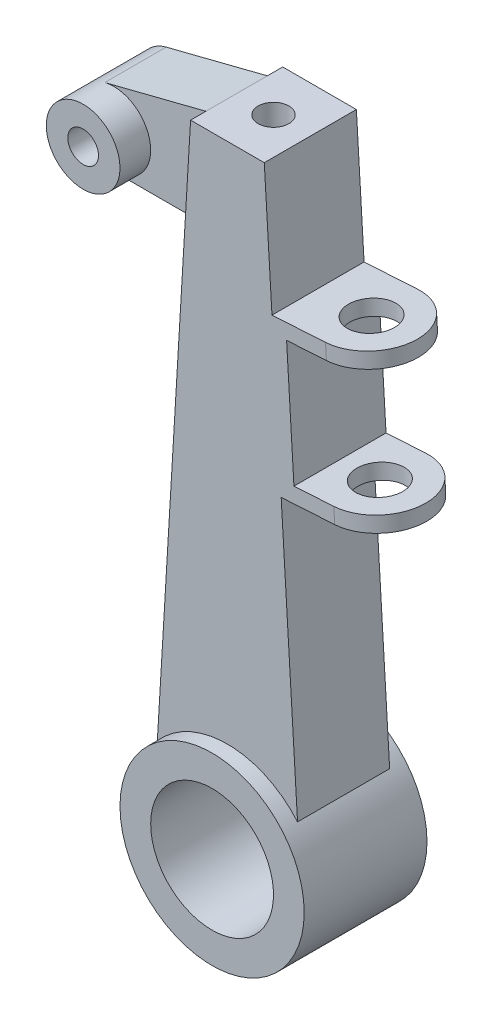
ISO-10303-21;
HEADER;
FILE_DESCRIPTION(('STEP AP214'),'2;1');
FILE_NAME('part.step','',(''),(''),'','','');
FILE_SCHEMA(('AUTOMOTIVE_DESIGN { 1 0 10303 214 1 1 1 1 }'));
ENDSEC;
DATA;
#1=APPLICATION_CONTEXT('core data for automotive mechanical design processes');
#2=APPLICATION_PROTOCOL_DEFINITION('international standard','automotive_design',2000,#1);
#3=PRODUCT_CONTEXT('',#1,'mechanical');
#4=PRODUCT('Part','Part','',(#3));
#5=PRODUCT_RELATED_PRODUCT_CATEGORY('part','',(#4));
#6=PRODUCT_DEFINITION_FORMATION('','',#4);
#7=PRODUCT_DEFINITION_CONTEXT('part definition',#1,'design');
#8=PRODUCT_DEFINITION('design','',#6,#7);
#9=PRODUCT_DEFINITION_SHAPE('','',#8);
#10=(LENGTH_UNIT() NAMED_UNIT(*) SI_UNIT(.MILLI.,.METRE.));
#11=(NAMED_UNIT(*) PLANE_ANGLE_UNIT() SI_UNIT($,.RADIAN.));
#12=(NAMED_UNIT(*) SI_UNIT($,.STERADIAN.) SOLID_ANGLE_UNIT());
#13=UNCERTAINTY_MEASURE_WITH_UNIT(LENGTH_MEASURE(1.E-05),#10,'distance_accuracy_value','');
#14=(GEOMETRIC_REPRESENTATION_CONTEXT(3) GLOBAL_UNCERTAINTY_ASSIGNED_CONTEXT((#13)) GLOBAL_UNIT_ASSIGNED_CONTEXT((#10,
#11,#12)) REPRESENTATION_CONTEXT('',''));
#15=CARTESIAN_POINT('',(0.,0.,0.));
#16=DIRECTION('',(0.,0.,1.));
#17=DIRECTION('',(1.,0.,0.));
#18=AXIS2_PLACEMENT_3D('',#15,#16,#17);
#19=CARTESIAN_POINT('',(-11.5353761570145,-3.23596435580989,12.2157183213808));
#20=DIRECTION('',(4.96598466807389E-05,2.97959143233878E-06,0.999999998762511));
#21=DIRECTION('',(0.99999999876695,0.,-4.96598466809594E-05));
#22=AXIS2_PLACEMENT_3D('',#19,#20,#21);
#23=PLANE('',#22);
#24=CARTESIAN_POINT('',(-19.0493937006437,-12.6999631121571,12.2161196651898));
#25=DIRECTION('',(-4.96598467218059E-05,-2.97959144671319E-06,-0.999999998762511));
#26=DIRECTION('',(-0.99999999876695,0.,4.96598467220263E-05));
#27=AXIS2_PLACEMENT_3D('',#24,#25,#26);
#28=CIRCLE('',#27,7.61999999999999);
#29=CARTESIAN_POINT('',(-26.6693936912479,-12.6999631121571,12.2164980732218));
#30=VERTEX_POINT('',#29);
#31=EDGE_CURVE('E354',#30,#30,#28,.T.);
#32=ORIENTED_EDGE('',*,*,#31,.F.);
#33=EDGE_LOOP('',(#32));
#34=FACE_BOUND('',#33,.T.);
#35=CARTESIAN_POINT('',(-19.0493937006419,-12.6999631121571,12.21611966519));
#36=DIRECTION('',(-4.96598467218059E-05,-2.97959144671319E-06,-0.999999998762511));
#37=DIRECTION('',(-0.99999999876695,0.,4.96598467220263E-05));
#38=AXIS2_PLACEMENT_3D('',#35,#36,#37);
#39=CIRCLE('',#38,3.17500000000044);
#40=CARTESIAN_POINT('',(-22.2243936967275,-12.6999631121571,12.2162773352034));
#41=VERTEX_POINT('',#40);
#42=EDGE_CURVE('E38',#41,#41,#39,.T.);
#43=ORIENTED_EDGE('',*,*,#42,.T.);
#44=EDGE_LOOP('',(#43));
#45=FACE_BOUND('',#44,.T.);
#46=ADVANCED_FACE('F34',(#34,#45),#23,.T.);
#47=CARTESIAN_POINT('',(7.61997558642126,-12.7000016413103,-0.485204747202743));
#48=DIRECTION('',(-2.56616028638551E-08,-0.999999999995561,2.97959271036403E-06));
#49=DIRECTION('',(0.,-2.97959271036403E-06,-0.999999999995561));
#50=AXIS2_PLACEMENT_3D('',#47,#48,#49);
#51=PLANE('',#50);
#52=CARTESIAN_POINT('',(7.61997558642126,-12.7000016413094,-0.485204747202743));
#53=DIRECTION('',(-2.56616425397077E-08,-0.999999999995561,2.97959271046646E-06));
#54=DIRECTION('',(0.,-2.97959271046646E-06,-0.999999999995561));
#55=AXIS2_PLACEMENT_3D('',#52,#53,#54);
#56=CIRCLE('',#55,3.175);
#57=CARTESIAN_POINT('',(7.61997558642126,-12.7000111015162,-3.66020474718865));
#58=VERTEX_POINT('',#57);
#59=EDGE_CURVE('E132',#58,#58,#56,.F.);
#60=ORIENTED_EDGE('',*,*,#59,.T.);
#61=EDGE_LOOP('',(#60));
#62=FACE_BOUND('',#61,.T.);
#63=ADVANCED_FACE('F364',(#62),#51,.F.);
#64=CARTESIAN_POINT('',(-19.0493937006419,-12.6999631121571,12.2161196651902));
#65=DIRECTION('',(-4.96598467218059E-05,-2.97959144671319E-06,-0.999999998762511));
#66=DIRECTION('',(-0.99999999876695,0.,4.96598467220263E-05));
#67=AXIS2_PLACEMENT_3D('',#64,#65,#66);
#68=CYLINDRICAL_SURFACE('',#67,3.17500000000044);
#69=ORIENTED_EDGE('',*,*,#42,.F.);
#70=EDGE_LOOP('',(#69));
#71=FACE_BOUND('',#70,.T.);
#72=CARTESIAN_POINT('',(-19.050339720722,-12.7000198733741,-6.83388031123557));
#73=DIRECTION('',(-4.96598467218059E-05,-2.97959144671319E-06,-0.999999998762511));
#74=DIRECTION('',(-0.99999999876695,0.,4.96598467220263E-05));
#75=AXIS2_PLACEMENT_3D('',#72,#73,#74);
#76=CIRCLE('',#75,3.17500000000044);
#77=CARTESIAN_POINT('',(-22.2253397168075,-12.7000198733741,-6.83372264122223));
#78=VERTEX_POINT('',#77);
#79=EDGE_CURVE('E152',#78,#78,#76,.F.);
#80=ORIENTED_EDGE('',*,*,#79,.F.);
#81=EDGE_LOOP('',(#80));
#82=FACE_BOUND('',#81,.T.);
#83=ADVANCED_FACE('F361',(#71,#82),#68,.F.);
#84=CARTESIAN_POINT('',(-19.0493937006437,-12.6999631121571,12.2161196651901));
#85=DIRECTION('',(-4.96598467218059E-05,-2.97959144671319E-06,-0.999999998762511));
#86=DIRECTION('',(-0.99999999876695,0.,4.96598467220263E-05));
#87=AXIS2_PLACEMENT_3D('',#84,#85,#86);
#88=CYLINDRICAL_SURFACE('',#87,7.61999999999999);
#89=CARTESIAN_POINT('',(-19.0497090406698,-12.6999820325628,5.86611967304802));
#90=DIRECTION('',(-4.96598467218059E-05,-2.97959144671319E-06,-0.999999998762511));
#91=DIRECTION('',(-0.99999999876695,0.,4.96598467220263E-05));
#92=AXIS2_PLACEMENT_3D('',#89,#90,#91);
#93=CIRCLE('',#92,7.61999999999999);
#94=CARTESIAN_POINT('',(-20.9254011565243,-5.31444352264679,5.86619081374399));
#95=VERTEX_POINT('',#94);
#96=CARTESIAN_POINT('',(-19.0497092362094,-20.3199820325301,5.86614237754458));
#97=VERTEX_POINT('',#96);
#98=EDGE_CURVE('E111',#95,#97,#93,.T.);
#99=ORIENTED_EDGE('',*,*,#98,.F.);
#100=DIRECTION('',(4.96598466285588E-05,2.97959144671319E-06,0.999999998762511));
#101=VECTOR('',#100,1.);
#102=CARTESIAN_POINT('',(-20.9260318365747,-5.31448136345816,-6.83380917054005));
#103=LINE('',#102,#101);
#104=CARTESIAN_POINT('',(-20.9260318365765,-5.31448136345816,-6.83380917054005));
#105=VERTEX_POINT('',#104);
#106=EDGE_CURVE('E117',#105,#95,#103,.T.);
#107=ORIENTED_EDGE('',*,*,#106,.F.);
#108=CARTESIAN_POINT('',(-19.0503397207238,-12.7000198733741,-6.83388031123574));
#109=DIRECTION('',(-4.96598467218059E-05,-2.97959144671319E-06,-0.999999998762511));
#110=DIRECTION('',(-0.99999999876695,0.,4.96598467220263E-05));
#111=AXIS2_PLACEMENT_3D('',#108,#109,#110);
#112=CIRCLE('',#111,7.61999999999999);
#113=CARTESIAN_POINT('',(-19.0503398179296,-20.3200201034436,-6.83385760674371));
#114=VERTEX_POINT('',#113);
#115=EDGE_CURVE('E146',#114,#105,#112,.T.);
#116=ORIENTED_EDGE('',*,*,#115,.F.);
#117=DIRECTION('',(-4.96598467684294E-05,-2.97959144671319E-06,-0.999999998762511));
#118=VECTOR('',#117,1.);
#119=CARTESIAN_POINT('',(-19.0497092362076,-20.3199820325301,5.86614237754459));
#120=LINE('',#119,#118);
#121=EDGE_CURVE('E120',#97,#114,#120,.T.);
#122=ORIENTED_EDGE('',*,*,#121,.F.);
#123=EDGE_LOOP('',(#99,#107,#116,#122));
#124=FACE_BOUND('',#123,.T.);
#125=ORIENTED_EDGE('',*,*,#31,.T.);
#126=EDGE_LOOP('',(#125));
#127=FACE_BOUND('',#126,.T.);
#128=ADVANCED_FACE('F115',(#124,#127),#88,.T.);
#129=CARTESIAN_POINT('',(27.903497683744,-25.8530921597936,-0.486172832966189));
#130=DIRECTION('',(0.0598922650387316,-0.998204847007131,1.9112008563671E-12));
#131=DIRECTION('',(0.998204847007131,0.0598922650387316,0.));
#132=AXIS2_PLACEMENT_3D('',#129,#130,#131);
#133=CYLINDRICAL_SURFACE('',#132,4.7625);
#134=CARTESIAN_POINT('',(27.903497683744,-25.8530921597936,-0.486172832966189));
#135=DIRECTION('',(0.0598922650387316,-0.998204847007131,1.9112008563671E-12));
#136=DIRECTION('',(0.998204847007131,0.0598922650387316,0.));
#137=AXIS2_PLACEMENT_3D('',#134,#135,#136);
#138=CIRCLE('',#137,4.7625);
#139=CARTESIAN_POINT('',(32.6574482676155,-25.5678552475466,-0.486172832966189));
#140=VERTEX_POINT('',#139);
#141=EDGE_CURVE('E341',#140,#140,#138,.T.);
#142=ORIENTED_EDGE('',*,*,#141,.F.);
#143=EDGE_LOOP('',(#142));
#144=FACE_BOUND('',#143,.T.);
#145=CARTESIAN_POINT('',(28.093655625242,-29.022392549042,-0.486172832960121));
#146=DIRECTION('',(0.0598922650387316,-0.998204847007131,1.9112008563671E-12));
#147=DIRECTION('',(0.998204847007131,0.0598922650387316,0.));
#148=AXIS2_PLACEMENT_3D('',#145,#146,#147);
#149=CIRCLE('',#148,4.7625);
#150=CARTESIAN_POINT('',(32.8476062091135,-28.737155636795,-0.486172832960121));
#151=VERTEX_POINT('',#150);
#152=EDGE_CURVE('E242',#151,#151,#149,.F.);
#153=ORIENTED_EDGE('',*,*,#152,.F.);
#154=EDGE_LOOP('',(#153));
#155=FACE_BOUND('',#154,.T.);
#156=ADVANCED_FACE('F651',(#144,#155),#133,.F.);
#157=CARTESIAN_POINT('',(7.61997591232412,-1.64136740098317E-06,-0.485242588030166));
#158=DIRECTION('',(-2.56616425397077E-08,-0.999999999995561,2.97959271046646E-06));
#159=DIRECTION('',(0.,-2.97959271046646E-06,-0.999999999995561));
#160=AXIS2_PLACEMENT_3D('',#157,#158,#159);
#161=CYLINDRICAL_SURFACE('',#160,3.175);
#162=CARTESIAN_POINT('',(7.61997591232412,-1.64136740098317E-06,-0.485242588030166));
#163=DIRECTION('',(-2.56616425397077E-08,-0.999999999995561,2.97959271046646E-06));
#164=DIRECTION('',(0.,-2.97959271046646E-06,-0.999999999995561));
#165=AXIS2_PLACEMENT_3D('',#162,#163,#164);
#166=CIRCLE('',#165,3.175);
#167=CARTESIAN_POINT('',(7.61997591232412,-1.11015742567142E-05,-3.66024258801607));
#168=VERTEX_POINT('',#167);
#169=EDGE_CURVE('E222',#168,#168,#166,.T.);
#170=ORIENTED_EDGE('',*,*,#169,.F.);
#171=EDGE_LOOP('',(#170));
#172=FACE_BOUND('',#171,.T.);
#173=ORIENTED_EDGE('',*,*,#59,.F.);
#174=EDGE_LOOP('',(#173));
#175=FACE_BOUND('',#174,.T.);
#176=ADVANCED_FACE('F660',(#172,#175),#161,.F.);
#177=CARTESIAN_POINT('',(-2.40782800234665E-05,-1.44469716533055E-06,-0.484864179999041));
#178=DIRECTION('',(-0.246153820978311,0.969230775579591,9.33604930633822E-06));
#179=DIRECTION('',(-0.969230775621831,-0.246153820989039,0.));
#180=AXIS2_PLACEMENT_3D('',#177,#178,#179);
#181=PLANE('',#180);
#182=DIRECTION('',(-0.969230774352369,-0.246153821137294,4.88652895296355E-05));
#183=VECTOR('',#182,1.);
#184=CARTESIAN_POINT('',(0.000291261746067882,1.74757076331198E-05,5.8651358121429));
#185=LINE('',#184,#183);
#186=CARTESIAN_POINT('',(0.000291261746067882,1.74757076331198E-05,5.86513581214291));
#187=VERTEX_POINT('',#186);
#188=EDGE_CURVE('E122',#187,#95,#185,.T.);
#189=ORIENTED_EDGE('',*,*,#188,.F.);
#190=DIRECTION('',(4.96598467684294E-05,2.97959144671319E-06,0.999999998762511));
#191=VECTOR('',#190,1.);
#192=CARTESIAN_POINT('',(-0.000339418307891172,-2.03651028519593E-05,-6.83486417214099));
#193=LINE('',#192,#191);
#194=CARTESIAN_POINT('',(-0.000339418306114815,-2.03651028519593E-05,-6.83486417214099));
#195=VERTEX_POINT('',#194);
#196=EDGE_CURVE('E211',#195,#187,#193,.T.);
#197=ORIENTED_EDGE('',*,*,#196,.F.);
#198=DIRECTION('',(0.969230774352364,0.246153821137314,-4.88652895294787E-05));
#199=VECTOR('',#198,1.);
#200=CARTESIAN_POINT('',(-20.9260318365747,-5.31448136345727,-6.83380917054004));
#201=LINE('',#200,#199);
#202=EDGE_CURVE('E130',#105,#195,#201,.T.);
#203=ORIENTED_EDGE('',*,*,#202,.F.);
#204=ORIENTED_EDGE('',*,*,#106,.T.);
#205=EDGE_LOOP('',(#189,#197,#203,#204));
#206=FACE_BOUND('',#205,.T.);
#207=ADVANCED_FACE('F126',(#206),#181,.T.);
#208=CARTESIAN_POINT('',(29.6149191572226,-54.3767956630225,-0.486172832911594));
#209=DIRECTION('',(0.0598922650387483,-0.99820484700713,1.91120085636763E-12));
#210=DIRECTION('',(0.99820484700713,0.0598922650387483,0.));
#211=AXIS2_PLACEMENT_3D('',#208,#209,#210);
#212=CYLINDRICAL_SURFACE('',#211,4.7625);
#213=CARTESIAN_POINT('',(29.6149191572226,-54.3767956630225,-0.486172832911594));
#214=DIRECTION('',(0.0598922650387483,-0.99820484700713,1.91120085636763E-12));
#215=DIRECTION('',(0.99820484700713,0.0598922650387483,0.));
#216=AXIS2_PLACEMENT_3D('',#213,#214,#215);
#217=CIRCLE('',#216,4.7625);
#218=CARTESIAN_POINT('',(34.3688697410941,-54.0915587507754,-0.486172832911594));
#219=VERTEX_POINT('',#218);
#220=EDGE_CURVE('E145',#219,#219,#217,.T.);
#221=ORIENTED_EDGE('',*,*,#220,.F.);
#222=EDGE_LOOP('',(#221));
#223=FACE_BOUND('',#222,.T.);
#224=CARTESIAN_POINT('',(29.8050770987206,-57.5460960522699,-0.486172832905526));
#225=DIRECTION('',(0.0598922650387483,-0.99820484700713,1.91120085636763E-12));
#226=DIRECTION('',(0.99820484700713,0.0598922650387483,0.));
#227=AXIS2_PLACEMENT_3D('',#224,#225,#226);
#228=CIRCLE('',#227,4.7625);
#229=CARTESIAN_POINT('',(34.5590276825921,-57.2608591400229,-0.486172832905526));
#230=VERTEX_POINT('',#229);
#231=EDGE_CURVE('E210',#230,#230,#228,.F.);
#232=ORIENTED_EDGE('',*,*,#231,.F.);
#233=EDGE_LOOP('',(#232));
#234=FACE_BOUND('',#233,.T.);
#235=ADVANCED_FACE('F407',(#223,#234),#212,.F.);
#236=CARTESIAN_POINT('',(7.62060333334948,-126.999963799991,12.2151358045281));
#237=DIRECTION('',(-4.96598466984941E-05,-2.97959144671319E-06,-0.999999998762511));
#238=DIRECTION('',(-0.99999999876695,0.,4.96598466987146E-05));
#239=AXIS2_PLACEMENT_3D('',#236,#237,#238);
#240=CYLINDRICAL_SURFACE('',#239,12.7);
#241=CARTESIAN_POINT('',(7.62060333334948,-126.999963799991,12.2151358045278));
#242=DIRECTION('',(-4.96598466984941E-05,-2.97959144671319E-06,-0.999999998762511));
#243=DIRECTION('',(-0.99999999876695,0.,4.96598466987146E-05));
#244=AXIS2_PLACEMENT_3D('',#241,#242,#243);
#245=CIRCLE('',#244,12.7);
#246=CARTESIAN_POINT('',(-5.07939665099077,-126.999963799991,12.2157664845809));
#247=VERTEX_POINT('',#246);
#248=EDGE_CURVE('E195',#247,#247,#245,.T.);
#249=ORIENTED_EDGE('',*,*,#248,.F.);
#250=EDGE_LOOP('',(#249));
#251=FACE_BOUND('',#250,.T.);
#252=CARTESIAN_POINT('',(7.61934197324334,-127.000039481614,-13.18486416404));
#253=DIRECTION('',(-4.96598466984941E-05,-2.97959144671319E-06,-0.999999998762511));
#254=DIRECTION('',(-0.99999999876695,0.,4.96598466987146E-05));
#255=AXIS2_PLACEMENT_3D('',#252,#253,#254);
#256=CIRCLE('',#255,12.7);
#257=CARTESIAN_POINT('',(-5.08065801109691,-127.000039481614,-13.1842334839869));
#258=VERTEX_POINT('',#257);
#259=EDGE_CURVE('E328',#258,#258,#256,.T.);
#260=ORIENTED_EDGE('',*,*,#259,.T.);
#261=EDGE_LOOP('',(#260));
#262=FACE_BOUND('',#261,.T.);
#263=ADVANCED_FACE('F404',(#251,#262),#240,.F.);
#264=CARTESIAN_POINT('',(-46.6009311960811,4.83376644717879,5.86743561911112));
#265=DIRECTION('',(4.96598466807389E-05,2.97959143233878E-06,0.999999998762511));
#266=DIRECTION('',(0.99999999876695,0.,-4.96598466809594E-05));
#267=AXIS2_PLACEMENT_3D('',#264,#265,#266);
#268=PLANE('',#267);
#269=DIRECTION('',(-0.0598923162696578,-0.998204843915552,5.94848585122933E-06));
#270=VECTOR('',#269,1.);
#271=CARTESIAN_POINT('',(0.000291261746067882,1.74757076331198E-05,5.86513581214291));
#272=LINE('',#271,#270);
#273=CARTESIAN_POINT('',(-1.21890925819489,-20.3199824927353,5.86525690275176));
#274=VERTEX_POINT('',#273);
#275=EDGE_CURVE('E136',#187,#274,#272,.T.);
#276=ORIENTED_EDGE('',*,*,#275,.F.);
#277=ORIENTED_EDGE('',*,*,#188,.T.);
#278=ORIENTED_EDGE('',*,*,#98,.T.);
#279=DIRECTION('',(-0.999999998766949,2.58096156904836E-08,4.96598466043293E-05));
#280=VECTOR('',#279,1.);
#281=CARTESIAN_POINT('',(-1.21890925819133,-20.3199824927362,5.86525690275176));
#282=LINE('',#281,#280);
#283=EDGE_CURVE('E138',#274,#97,#282,.T.);
#284=ORIENTED_EDGE('',*,*,#283,.F.);
#285=EDGE_LOOP('',(#276,#277,#278,#284));
#286=FACE_BOUND('',#285,.T.);
#287=ADVANCED_FACE('F134',(#286),#268,.T.);
#288=CARTESIAN_POINT('',(-19.0500245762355,-20.3200009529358,-0.48385761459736));
#289=DIRECTION('',(-2.56616028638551E-08,-0.999999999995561,2.97959271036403E-06));
#290=DIRECTION('',(0.,-2.97959271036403E-06,-0.999999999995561));
#291=AXIS2_PLACEMENT_3D('',#288,#289,#290);
#292=PLANE('',#291);
#293=ORIENTED_EDGE('',*,*,#283,.T.);
#294=ORIENTED_EDGE('',*,*,#121,.T.);
#295=DIRECTION('',(-0.99999999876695,0.,4.96598466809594E-05));
#296=VECTOR('',#295,1.);
#297=CARTESIAN_POINT('',(-19.0503399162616,-20.3200203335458,-6.83385760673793));
#298=LINE('',#297,#296);
#299=CARTESIAN_POINT('',(-1.21953993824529,-20.3200203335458,-6.83474308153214));
#300=VERTEX_POINT('',#299);
#301=EDGE_CURVE('E149',#300,#114,#298,.T.);
#302=ORIENTED_EDGE('',*,*,#301,.F.);
#303=DIRECTION('',(-4.96598466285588E-05,-2.97959137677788E-06,-0.999999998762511));
#304=VECTOR('',#303,1.);
#305=CARTESIAN_POINT('',(-1.21890925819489,-20.3199824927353,5.86525690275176));
#306=LINE('',#305,#304);
#307=EDGE_CURVE('E273',#274,#300,#306,.T.);
#308=ORIENTED_EDGE('',*,*,#307,.F.);
#309=EDGE_LOOP('',(#293,#294,#302,#308));
#310=FACE_BOUND('',#309,.T.);
#311=ADVANCED_FACE('F371',(#310),#292,.T.);
#312=CARTESIAN_POINT('',(-19.0503399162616,-20.3200198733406,-6.8338576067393));
#313=DIRECTION('',(-4.96598466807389E-05,-2.97959143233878E-06,-0.999999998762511));
#314=DIRECTION('',(-0.99999999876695,0.,4.96598466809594E-05));
#315=AXIS2_PLACEMENT_3D('',#312,#313,#314);
#316=PLANE('',#315);
#317=ORIENTED_EDGE('',*,*,#202,.T.);
#318=DIRECTION('',(0.0598923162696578,0.998204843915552,-5.94848585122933E-06));
#319=VECTOR('',#318,1.);
#320=CARTESIAN_POINT('',(-1.21953993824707,-20.3200203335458,-6.83474308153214));
#321=LINE('',#320,#319);
#322=EDGE_CURVE('E199',#300,#195,#321,.T.);
#323=ORIENTED_EDGE('',*,*,#322,.F.);
#324=ORIENTED_EDGE('',*,*,#301,.T.);
#325=ORIENTED_EDGE('',*,*,#115,.T.);
#326=EDGE_LOOP('',(#317,#323,#324,#325));
#327=FACE_BOUND('',#326,.T.);
#328=ORIENTED_EDGE('',*,*,#79,.T.);
#329=EDGE_LOOP('',(#328));
#330=FACE_BOUND('',#329,.T.);
#331=ADVANCED_FACE('F368',(#327,#330),#316,.T.);
#332=CARTESIAN_POINT('',(21.3747381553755,-54.8712063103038,-0.485762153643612));
#333=DIRECTION('',(-0.0598922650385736,0.998204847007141,-1.91068377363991E-12));
#334=DIRECTION('',(-0.998204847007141,-0.0598922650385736,0.));
#335=AXIS2_PLACEMENT_3D('',#332,#333,#334);
#336=PLANE('',#335);
#337=DIRECTION('',(0.998204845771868,0.0598922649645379,-4.97491541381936E-05));
#338=VECTOR('',#337,1.);
#339=CARTESIAN_POINT('',(21.3752111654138,-54.8711779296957,9.0392378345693));
#340=LINE('',#339,#338);
#341=CARTESIAN_POINT('',(21.375211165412,-54.8711779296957,9.03923783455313));
#342=VERTEX_POINT('',#341);
#343=CARTESIAN_POINT('',(29.6153921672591,-54.3767672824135,9.03882715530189));
#344=VERTEX_POINT('',#343);
#345=EDGE_CURVE('E286',#342,#344,#340,.T.);
#346=ORIENTED_EDGE('',*,*,#345,.T.);
#347=CARTESIAN_POINT('',(29.6149191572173,-54.3767956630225,-0.486172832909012));
#348=DIRECTION('',(-0.0598922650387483,0.99820484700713,-1.91120085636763E-12));
#349=DIRECTION('',(-0.99820484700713,-0.0598922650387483,0.));
#350=AXIS2_PLACEMENT_3D('',#347,#348,#349);
#351=CIRCLE('',#350,9.52500000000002);
#352=CARTESIAN_POINT('',(29.614446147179,-54.3768240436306,-10.0111728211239));
#353=VERTEX_POINT('',#352);
#354=EDGE_CURVE('E331',#353,#344,#351,.F.);
#355=ORIENTED_EDGE('',*,*,#354,.F.);
#356=DIRECTION('',(-0.998204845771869,-0.059892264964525,4.97491541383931E-05));
#357=VECTOR('',#356,1.);
#358=CARTESIAN_POINT('',(29.6144461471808,-54.3768240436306,-10.0111728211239));
#359=LINE('',#358,#357);
#360=CARTESIAN_POINT('',(21.3742651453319,-54.8712346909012,-10.0107621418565));
#361=VERTEX_POINT('',#360);
#362=EDGE_CURVE('E247',#353,#361,#359,.T.);
#363=ORIENTED_EDGE('',*,*,#362,.T.);
#364=DIRECTION('',(4.96598467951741E-05,2.97958952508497E-06,0.999999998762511));
#365=VECTOR('',#364,1.);
#366=CARTESIAN_POINT('',(21.3747381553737,-54.871206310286,-0.485762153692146));
#367=LINE('',#366,#365);
#368=EDGE_CURVE('E250',#342,#361,#367,.F.);
#369=ORIENTED_EDGE('',*,*,#368,.F.);
#370=EDGE_LOOP('',(#346,#355,#363,#369));
#371=FACE_BOUND('',#370,.T.);
#372=ORIENTED_EDGE('',*,*,#220,.T.);
#373=EDGE_LOOP('',(#372));
#374=FACE_BOUND('',#373,.T.);
#375=ADVANCED_FACE('F370',(#371,#374),#336,.T.);
#376=CARTESIAN_POINT('',(19.8534746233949,-29.5168031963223,-0.485762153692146));
#377=DIRECTION('',(0.998204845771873,0.0598922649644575,-4.97491541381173E-05));
#378=DIRECTION('',(-0.0598922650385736,0.998204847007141,0.));
#379=AXIS2_PLACEMENT_3D('',#376,#377,#378);
#380=PLANE('',#379);
#381=DIRECTION('',(-0.059892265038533,0.998204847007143,-1.91092767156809E-12));
#382=VECTOR('',#381,1.);
#383=CARTESIAN_POINT('',(21.3742651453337,-54.8712346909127,-10.0107621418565));
#384=LINE('',#383,#382);
#385=CARTESIAN_POINT('',(19.8530016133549,-29.5168315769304,-10.0107621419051));
#386=VERTEX_POINT('',#385);
#387=EDGE_CURVE('E235',#361,#386,#384,.T.);
#388=ORIENTED_EDGE('',*,*,#387,.T.);
#389=DIRECTION('',(-4.96598466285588E-05,-2.97959140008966E-06,-0.999999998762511));
#390=VECTOR('',#389,1.);
#391=CARTESIAN_POINT('',(19.8539476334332,-29.5167748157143,9.03923783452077));
#392=LINE('',#391,#390);
#393=CARTESIAN_POINT('',(19.8539476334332,-29.5167748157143,9.03923783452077));
#394=VERTEX_POINT('',#393);
#395=EDGE_CURVE('E238',#394,#386,#392,.T.);
#396=ORIENTED_EDGE('',*,*,#395,.F.);
#397=DIRECTION('',(0.0598922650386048,-0.998204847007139,1.91065448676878E-12));
#398=VECTOR('',#397,1.);
#399=CARTESIAN_POINT('',(19.8539476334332,-29.5167748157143,9.03923783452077));
#400=LINE('',#399,#398);
#401=EDGE_CURVE('E289',#394,#342,#400,.T.);
#402=ORIENTED_EDGE('',*,*,#401,.T.);
#403=ORIENTED_EDGE('',*,*,#368,.T.);
#404=EDGE_LOOP('',(#388,#396,#402,#403));
#405=FACE_BOUND('',#404,.T.);
#406=ADVANCED_FACE('F378',(#405),#380,.T.);
#407=CARTESIAN_POINT('',(37.6015567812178,-28.451918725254,-0.486646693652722));
#408=DIRECTION('',(0.0598922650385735,-0.998204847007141,1.91068377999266E-12));
#409=DIRECTION('',(0.998204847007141,0.0598922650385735,0.));
#410=AXIS2_PLACEMENT_3D('',#407,#408,#409);
#411=PLANE('',#410);
#412=DIRECTION('',(0.998204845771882,0.0598922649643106,-4.97491541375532E-05));
#413=VECTOR('',#412,1.);
#414=CARTESIAN_POINT('',(19.8530016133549,-29.5168315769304,-10.0107621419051));
#415=LINE('',#414,#413);
#416=CARTESIAN_POINT('',(28.093182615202,-29.02242092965,-10.0111728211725));
#417=VERTEX_POINT('',#416);
#418=EDGE_CURVE('E233',#386,#417,#415,.T.);
#419=ORIENTED_EDGE('',*,*,#418,.T.);
#420=CARTESIAN_POINT('',(28.0936556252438,-29.0223925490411,-0.48617283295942));
#421=DIRECTION('',(0.059892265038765,-0.998204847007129,1.91120085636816E-12));
#422=DIRECTION('',(0.998204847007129,0.059892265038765,0.));
#423=AXIS2_PLACEMENT_3D('',#420,#421,#422);
#424=CIRCLE('',#423,9.52500000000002);
#425=CARTESIAN_POINT('',(28.0941286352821,-29.0223641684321,9.03882715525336));
#426=VERTEX_POINT('',#425);
#427=EDGE_CURVE('E241',#426,#417,#424,.F.);
#428=ORIENTED_EDGE('',*,*,#427,.F.);
#429=DIRECTION('',(-0.998204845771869,-0.059892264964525,4.97491541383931E-05));
#430=VECTOR('',#429,1.);
#431=CARTESIAN_POINT('',(28.0941286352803,-29.0223641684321,9.03882715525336));
#432=LINE('',#431,#430);
#433=EDGE_CURVE('E296',#426,#394,#432,.T.);
#434=ORIENTED_EDGE('',*,*,#433,.T.);
#435=ORIENTED_EDGE('',*,*,#395,.T.);
#436=EDGE_LOOP('',(#419,#428,#434,#435));
#437=FACE_BOUND('',#436,.T.);
#438=ORIENTED_EDGE('',*,*,#152,.T.);
#439=EDGE_LOOP('',(#438));
#440=FACE_BOUND('',#439,.T.);
#441=ADVANCED_FACE('F490',(#437,#440),#411,.T.);
#442=CARTESIAN_POINT('',(27.9034976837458,-25.8530921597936,-0.486172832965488));
#443=DIRECTION('',(0.059892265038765,-0.998204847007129,1.91120085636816E-12));
#444=DIRECTION('',(0.998204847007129,0.059892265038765,0.));
#445=AXIS2_PLACEMENT_3D('',#442,#443,#444);
#446=CYLINDRICAL_SURFACE('',#445,9.52500000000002);
#447=DIRECTION('',(-0.0598922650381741,0.998204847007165,-1.91229359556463E-12));
#448=VECTOR('',#447,1.);
#449=CARTESIAN_POINT('',(28.093182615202,-29.02242092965,-10.0111728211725));
#450=LINE('',#449,#448);
#451=CARTESIAN_POINT('',(27.9030246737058,-25.8531205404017,-10.0111728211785));
#452=VERTEX_POINT('',#451);
#453=EDGE_CURVE('E228',#417,#452,#450,.T.);
#454=ORIENTED_EDGE('',*,*,#453,.T.);
#455=CARTESIAN_POINT('',(27.9034976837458,-25.8530921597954,-0.486172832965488));
#456=DIRECTION('',(0.059892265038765,-0.998204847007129,1.91120085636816E-12));
#457=DIRECTION('',(0.998204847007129,0.059892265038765,0.));
#458=AXIS2_PLACEMENT_3D('',#455,#456,#457);
#459=CIRCLE('',#458,9.52500000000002);
#460=CARTESIAN_POINT('',(27.9039706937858,-25.8530637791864,9.0388271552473));
#461=VERTEX_POINT('',#460);
#462=EDGE_CURVE('E223',#461,#452,#459,.F.);
#463=ORIENTED_EDGE('',*,*,#462,.F.);
#464=DIRECTION('',(0.0598922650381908,-0.998204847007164,1.91010811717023E-12));
#465=VECTOR('',#464,1.);
#466=CARTESIAN_POINT('',(27.903970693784,-25.8530637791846,9.03882715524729));
#467=LINE('',#466,#465);
#468=EDGE_CURVE('E301',#461,#426,#467,.T.);
#469=ORIENTED_EDGE('',*,*,#468,.T.);
#470=ORIENTED_EDGE('',*,*,#427,.T.);
#471=EDGE_LOOP('',(#454,#463,#469,#470));
#472=FACE_BOUND('',#471,.T.);
#473=ADVANCED_FACE('F494',(#472),#446,.T.);
#474=CARTESIAN_POINT('',(7.46784879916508,-27.0792305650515,-0.485154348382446));
#475=DIRECTION('',(-0.0598922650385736,0.998204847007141,-1.91068377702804E-12));
#476=DIRECTION('',(-0.998204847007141,-0.0598922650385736,0.));
#477=AXIS2_PLACEMENT_3D('',#474,#475,#476);
#478=PLANE('',#477);
#479=DIRECTION('',(0.998204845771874,0.0598922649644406,-4.97491541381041E-05));
#480=VECTOR('',#479,1.);
#481=CARTESIAN_POINT('',(16.8314945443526,-26.517412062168,9.03937899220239));
#482=LINE('',#481,#480);
#483=CARTESIAN_POINT('',(16.8314945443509,-26.517412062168,9.03937899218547));
#484=VERTEX_POINT('',#483);
#485=EDGE_CURVE('E306',#484,#461,#482,.T.);
#486=ORIENTED_EDGE('',*,*,#485,.T.);
#487=ORIENTED_EDGE('',*,*,#462,.T.);
#488=DIRECTION('',(-0.998204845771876,-0.0598922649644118,4.97491541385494E-05));
#489=VECTOR('',#488,1.);
#490=CARTESIAN_POINT('',(27.9030246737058,-25.8531205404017,-10.0111728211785));
#491=LINE('',#490,#489);
#492=CARTESIAN_POINT('',(16.8305485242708,-26.5174688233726,-10.0106209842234));
#493=VERTEX_POINT('',#492);
#494=EDGE_CURVE('E216',#452,#493,#491,.T.);
#495=ORIENTED_EDGE('',*,*,#494,.T.);
#496=DIRECTION('',(4.96598467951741E-05,2.97958952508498E-06,0.999999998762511));
#497=VECTOR('',#496,1.);
#498=CARTESIAN_POINT('',(16.8310215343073,-26.5174404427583,-0.485620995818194));
#499=LINE('',#498,#497);
#500=EDGE_CURVE('E219',#484,#493,#499,.F.);
#501=ORIENTED_EDGE('',*,*,#500,.F.);
#502=EDGE_LOOP('',(#486,#487,#495,#501));
#503=FACE_BOUND('',#502,.T.);
#504=ORIENTED_EDGE('',*,*,#141,.T.);
#505=EDGE_LOOP('',(#504));
#506=FACE_BOUND('',#505,.T.);
#507=ADVANCED_FACE('F496',(#503,#506),#478,.T.);
#508=CARTESIAN_POINT('',(22.8599726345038,-127.00000203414,-0.485620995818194));
#509=DIRECTION('',(0.998204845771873,0.0598922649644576,-4.97491541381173E-05));
#510=DIRECTION('',(-0.0598922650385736,0.998204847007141,0.));
#511=AXIS2_PLACEMENT_3D('',#508,#509,#510);
#512=PLANE('',#511);
#513=DIRECTION('',(-4.96598466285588E-05,-2.97959144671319E-06,-0.999999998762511));
#514=VECTOR('',#513,1.);
#515=CARTESIAN_POINT('',(15.2404489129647,2.65425731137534E-05,9.03937899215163));
#516=LINE('',#515,#514);
#517=CARTESIAN_POINT('',(15.2404488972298,2.68047971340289E-05,9.03937899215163));
#518=VERTEX_POINT('',#517);
#519=CARTESIAN_POINT('',(15.2395028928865,-3.02186448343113E-05,-10.0106209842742));
#520=VERTEX_POINT('',#519);
#521=EDGE_CURVE('E207',#518,#520,#516,.T.);
#522=ORIENTED_EDGE('',*,*,#521,.F.);
#523=DIRECTION('',(0.0598922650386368,-0.998204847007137,1.91063547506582E-12));
#524=VECTOR('',#523,1.);
#525=CARTESIAN_POINT('',(15.2404489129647,2.65425731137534E-05,9.03937899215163));
#526=LINE('',#525,#524);
#527=EDGE_CURVE('E261',#518,#484,#526,.T.);
#528=ORIENTED_EDGE('',*,*,#527,.T.);
#529=ORIENTED_EDGE('',*,*,#500,.T.);
#530=DIRECTION('',(-0.0598922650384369,0.998204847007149,-1.91070077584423E-12));
#531=VECTOR('',#530,1.);
#532=CARTESIAN_POINT('',(16.830548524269,-26.517468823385,-10.0106209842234));
#533=LINE('',#532,#531);
#534=EDGE_CURVE('E204',#493,#520,#533,.T.);
#535=ORIENTED_EDGE('',*,*,#534,.T.);
#536=EDGE_LOOP('',(#522,#528,#529,#535));
#537=FACE_BOUND('',#536,.T.);
#538=ADVANCED_FACE('F500',(#537),#512,.T.);
#539=CARTESIAN_POINT('',(-14.2810937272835,-1.07610933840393E-06,-0.484154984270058));
#540=DIRECTION('',(2.56616028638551E-08,0.999999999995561,-2.97959271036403E-06));
#541=DIRECTION('',(0.,2.97959271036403E-06,0.999999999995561));
#542=AXIS2_PLACEMENT_3D('',#539,#540,#541);
#543=PLANE('',#542);
#544=DIRECTION('',(-0.99999999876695,0.,4.96598466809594E-05));
#545=VECTOR('',#544,1.);
#546=CARTESIAN_POINT('',(22.8604456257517,2.69359109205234E-05,9.03900058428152));
#547=LINE('',#546,#545);
#548=CARTESIAN_POINT('',(0.000448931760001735,2.69359118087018E-05,9.04013580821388));
#549=VERTEX_POINT('',#548);
#550=EDGE_CURVE('E157',#549,#518,#547,.F.);
#551=ORIENTED_EDGE('',*,*,#550,.T.);
#552=ORIENTED_EDGE('',*,*,#521,.T.);
#553=DIRECTION('',(0.99999999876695,0.,-4.96598466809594E-05));
#554=VECTOR('',#553,1.);
#555=CARTESIAN_POINT('',(15.2395028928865,-3.02186439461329E-05,-10.0106209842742));
#556=LINE('',#555,#554);
#557=CARTESIAN_POINT('',(-0.000497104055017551,-3.00875301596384E-05,-10.0098641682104));
#558=VERTEX_POINT('',#557);
#559=EDGE_CURVE('E168',#520,#558,#556,.F.);
#560=ORIENTED_EDGE('',*,*,#559,.T.);
#561=DIRECTION('',(-4.96598469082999E-05,-2.9795915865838E-06,-0.999999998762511));
#562=VECTOR('',#561,1.);
#563=CARTESIAN_POINT('',(-0.000339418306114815,-2.03651028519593E-05,-6.83486417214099));
#564=LINE('',#563,#562);
#565=EDGE_CURVE('E182',#195,#558,#564,.T.);
#566=ORIENTED_EDGE('',*,*,#565,.F.);
#567=ORIENTED_EDGE('',*,*,#196,.T.);
#568=DIRECTION('',(-4.96598469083E-05,-2.97959158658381E-06,-0.999999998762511));
#569=VECTOR('',#568,1.);
#570=CARTESIAN_POINT('',(0.000448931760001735,2.69359109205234E-05,9.04013580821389));
#571=LINE('',#570,#569);
#572=EDGE_CURVE('E181',#549,#187,#571,.T.);
#573=ORIENTED_EDGE('',*,*,#572,.F.);
#574=EDGE_LOOP('',(#551,#552,#560,#566,#567,#573));
#575=FACE_BOUND('',#574,.T.);
#576=ORIENTED_EDGE('',*,*,#169,.T.);
#577=EDGE_LOOP('',(#576));
#578=FACE_BOUND('',#577,.T.);
#579=ADVANCED_FACE('F444',(#575,#578),#543,.T.);
#580=CARTESIAN_POINT('',(39.3129782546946,-56.9756222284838,-0.486646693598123));
#581=DIRECTION('',(0.0598922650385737,-0.998204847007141,1.91068377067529E-12));
#582=DIRECTION('',(0.998204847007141,0.0598922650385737,0.));
#583=AXIS2_PLACEMENT_3D('',#580,#581,#582);
#584=PLANE('',#583);
#585=DIRECTION('',(0.99820484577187,0.0598922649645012,-4.97491541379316E-05));
#586=VECTOR('',#585,1.);
#587=CARTESIAN_POINT('',(18.7321279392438,-58.2104727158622,-10.0106209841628));
#588=LINE('',#587,#586);
#589=CARTESIAN_POINT('',(18.7321279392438,-58.2104727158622,-10.0106209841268));
#590=VERTEX_POINT('',#589);
#591=CARTESIAN_POINT('',(29.804604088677,-57.5461244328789,-10.0111728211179));
#592=VERTEX_POINT('',#591);
#593=EDGE_CURVE('E164',#590,#592,#588,.T.);
#594=ORIENTED_EDGE('',*,*,#593,.T.);
#595=CARTESIAN_POINT('',(29.8050770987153,-57.5460960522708,-0.486172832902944));
#596=DIRECTION('',(-0.0598922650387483,0.99820484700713,-1.91120085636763E-12));
#597=DIRECTION('',(-0.99820484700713,-0.0598922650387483,0.));
#598=AXIS2_PLACEMENT_3D('',#595,#596,#597);
#599=CIRCLE('',#598,9.52500000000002);
#600=CARTESIAN_POINT('',(29.8055501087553,-57.5460676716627,9.03882715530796));
#601=VERTEX_POINT('',#600);
#602=EDGE_CURVE('E333',#601,#592,#599,.T.);
#603=ORIENTED_EDGE('',*,*,#602,.F.);
#604=DIRECTION('',(-0.998204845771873,-0.0598922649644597,4.97491541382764E-05));
#605=VECTOR('',#604,1.);
#606=CARTESIAN_POINT('',(29.8055501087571,-57.5460676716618,9.03882715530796));
#607=LINE('',#606,#605);
#608=CARTESIAN_POINT('',(18.7330739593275,-58.2104159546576,9.03937899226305));
#609=VERTEX_POINT('',#608);
#610=EDGE_CURVE('E158',#601,#609,#607,.T.);
#611=ORIENTED_EDGE('',*,*,#610,.T.);
#612=DIRECTION('',(4.96598467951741E-05,2.97958952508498E-06,0.999999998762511));
#613=VECTOR('',#612,1.);
#614=CARTESIAN_POINT('',(18.7326009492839,-58.2104443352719,-0.485620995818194));
#615=LINE('',#614,#613);
#616=EDGE_CURVE('E192',#590,#609,#615,.T.);
#617=ORIENTED_EDGE('',*,*,#616,.F.);
#618=EDGE_LOOP('',(#594,#603,#611,#617));
#619=FACE_BOUND('',#618,.T.);
#620=ORIENTED_EDGE('',*,*,#231,.T.);
#621=EDGE_LOOP('',(#620));
#622=FACE_BOUND('',#621,.T.);
#623=ADVANCED_FACE('F418',(#619,#622),#584,.T.);
#624=CARTESIAN_POINT('',(29.8050770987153,-57.5460960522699,-0.486172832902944));
#625=DIRECTION('',(-0.0598922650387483,0.99820484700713,-1.91120085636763E-12));
#626=DIRECTION('',(-0.99820484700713,-0.0598922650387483,0.));
#627=AXIS2_PLACEMENT_3D('',#624,#625,#626);
#628=CYLINDRICAL_SURFACE('',#627,9.52500000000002);
#629=DIRECTION('',(-0.0598922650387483,0.99820484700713,-1.9122935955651E-12));
#630=VECTOR('',#629,1.);
#631=CARTESIAN_POINT('',(29.8046040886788,-57.546124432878,-10.0111728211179));
#632=LINE('',#631,#630);
#633=EDGE_CURVE('E186',#592,#353,#632,.T.);
#634=ORIENTED_EDGE('',*,*,#633,.T.);
#635=ORIENTED_EDGE('',*,*,#354,.T.);
#636=DIRECTION('',(0.0598922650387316,-0.998204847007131,1.91065448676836E-12));
#637=VECTOR('',#636,1.);
#638=CARTESIAN_POINT('',(29.6153921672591,-54.3767672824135,9.03882715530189));
#639=LINE('',#638,#637);
#640=EDGE_CURVE('E283',#344,#601,#639,.T.);
#641=ORIENTED_EDGE('',*,*,#640,.T.);
#642=ORIENTED_EDGE('',*,*,#602,.T.);
#643=EDGE_LOOP('',(#634,#635,#641,#642));
#644=FACE_BOUND('',#643,.T.);
#645=ADVANCED_FACE('F412',(#644),#628,.T.);
#646=CARTESIAN_POINT('',(26.6693419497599,-127.000039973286,-13.1858101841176));
#647=DIRECTION('',(4.96598466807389E-05,2.97959143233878E-06,0.999999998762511));
#648=DIRECTION('',(0.99999999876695,0.,-4.96598466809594E-05));
#649=AXIS2_PLACEMENT_3D('',#646,#647,#648);
#650=PLANE('',#649);
#651=CARTESIAN_POINT('',(7.61934197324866,-127.000039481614,-13.1848641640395));
#652=DIRECTION('',(4.96598466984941E-05,2.97959144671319E-06,0.999999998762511));
#653=DIRECTION('',(0.99999999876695,0.,-4.96598466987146E-05));
#654=AXIS2_PLACEMENT_3D('',#651,#652,#653);
#655=CIRCLE('',#654,19.0500000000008);
#656=CARTESIAN_POINT('',(26.6693419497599,-127.000039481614,-13.1858101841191));
#657=VERTEX_POINT('',#656);
#658=EDGE_CURVE('E191',#657,#657,#655,.T.);
#659=ORIENTED_EDGE('',*,*,#658,.F.);
#660=EDGE_LOOP('',(#659));
#661=FACE_BOUND('',#660,.T.);
#662=ORIENTED_EDGE('',*,*,#259,.F.);
#663=EDGE_LOOP('',(#662));
#664=FACE_BOUND('',#663,.T.);
#665=ADVANCED_FACE('F400',(#661,#664),#650,.F.);
#666=CARTESIAN_POINT('',(23.4956033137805,-126.999964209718,12.2143474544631));
#667=DIRECTION('',(4.96598466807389E-05,2.97959143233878E-06,0.999999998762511));
#668=DIRECTION('',(0.99999999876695,0.,-4.96598466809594E-05));
#669=AXIS2_PLACEMENT_3D('',#666,#667,#668);
#670=PLANE('',#669);
#671=CARTESIAN_POINT('',(7.62060333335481,-126.999963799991,12.2151358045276));
#672=DIRECTION('',(4.96598466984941E-05,2.97959144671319E-06,0.999999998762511));
#673=DIRECTION('',(0.99999999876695,0.,-4.96598466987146E-05));
#674=AXIS2_PLACEMENT_3D('',#671,#672,#673);
#675=CIRCLE('',#674,19.0500000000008);
#676=CARTESIAN_POINT('',(26.6706033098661,-126.999963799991,12.214189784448));
#677=VERTEX_POINT('',#676);
#678=EDGE_CURVE('E177',#677,#677,#675,.F.);
#679=ORIENTED_EDGE('',*,*,#678,.F.);
#680=EDGE_LOOP('',(#679));
#681=FACE_BOUND('',#680,.T.);
#682=ORIENTED_EDGE('',*,*,#248,.T.);
#683=EDGE_LOOP('',(#682));
#684=FACE_BOUND('',#683,.T.);
#685=ADVANCED_FACE('F396',(#681,#684),#670,.T.);
#686=CARTESIAN_POINT('',(22.8599726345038,-127.00000203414,-0.485620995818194));
#687=DIRECTION('',(0.998204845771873,0.0598922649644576,-4.97491541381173E-05));
#688=DIRECTION('',(-0.0598922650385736,0.998204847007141,0.));
#689=AXIS2_PLACEMENT_3D('',#686,#687,#688);
#690=PLANE('',#689);
#691=DIRECTION('',(4.96598466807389E-05,2.97959143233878E-06,0.999999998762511));
#692=VECTOR('',#691,1.);
#693=CARTESIAN_POINT('',(22.1185575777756,-114.643079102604,-0.485620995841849));
#694=LINE('',#693,#692);
#695=CARTESIAN_POINT('',(22.1180845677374,-114.643107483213,-10.0106209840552));
#696=VERTEX_POINT('',#695);
#697=CARTESIAN_POINT('',(22.1190305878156,-114.643050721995,9.03937899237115));
#698=VERTEX_POINT('',#697);
#699=EDGE_CURVE('E174',#696,#698,#694,.T.);
#700=ORIENTED_EDGE('',*,*,#699,.F.);
#701=DIRECTION('',(-0.0598922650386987,0.998204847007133,-1.91066487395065E-12));
#702=VECTOR('',#701,1.);
#703=CARTESIAN_POINT('',(22.1180845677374,-114.643107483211,-10.0106209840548));
#704=LINE('',#703,#702);
#705=EDGE_CURVE('E161',#696,#590,#704,.T.);
#706=ORIENTED_EDGE('',*,*,#705,.T.);
#707=ORIENTED_EDGE('',*,*,#616,.T.);
#708=DIRECTION('',(0.0598922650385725,-0.998204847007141,1.91066487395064E-12));
#709=VECTOR('',#708,1.);
#710=CARTESIAN_POINT('',(18.7330739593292,-58.2104159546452,9.03937899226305));
#711=LINE('',#710,#709);
#712=EDGE_CURVE('E155',#609,#698,#711,.T.);
#713=ORIENTED_EDGE('',*,*,#712,.T.);
#714=EDGE_LOOP('',(#700,#706,#707,#713));
#715=FACE_BOUND('',#714,.T.);
#716=ADVANCED_FACE('F399',(#715),#690,.T.);
#717=CARTESIAN_POINT('',(22.8604456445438,-126.999973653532,9.03937899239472));
#718=DIRECTION('',(-4.96598466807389E-05,-2.97959143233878E-06,-0.999999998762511));
#719=DIRECTION('',(-0.99999999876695,0.,4.96598466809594E-05));
#720=AXIS2_PLACEMENT_3D('',#717,#718,#719);
#721=PLANE('',#720);
#722=ORIENTED_EDGE('',*,*,#345,.F.);
#723=ORIENTED_EDGE('',*,*,#401,.F.);
#724=ORIENTED_EDGE('',*,*,#433,.F.);
#725=ORIENTED_EDGE('',*,*,#468,.F.);
#726=ORIENTED_EDGE('',*,*,#485,.F.);
#727=ORIENTED_EDGE('',*,*,#527,.F.);
#728=ORIENTED_EDGE('',*,*,#550,.F.);
#729=DIRECTION('',(0.0598923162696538,0.998204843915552,-5.94848585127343E-06));
#730=VECTOR('',#729,1.);
#731=CARTESIAN_POINT('',(-6.87813862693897,-114.643049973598,9.04081898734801));
#732=LINE('',#731,#730);
#733=CARTESIAN_POINT('',(-6.87813862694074,-114.643049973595,9.04081898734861));
#734=VERTEX_POINT('',#733);
#735=EDGE_CURVE('E178',#734,#549,#732,.T.);
#736=ORIENTED_EDGE('',*,*,#735,.F.);
#737=CARTESIAN_POINT('',(7.62044566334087,-126.999973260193,9.04013580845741));
#738=DIRECTION('',(4.96598466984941E-05,2.97959144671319E-06,0.999999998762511));
#739=DIRECTION('',(0.99999999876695,0.,-4.96598466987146E-05));
#740=AXIS2_PLACEMENT_3D('',#737,#738,#739);
#741=CIRCLE('',#740,19.0500000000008);
#742=EDGE_CURVE('E173',#698,#734,#741,.T.);
#743=ORIENTED_EDGE('',*,*,#742,.F.);
#744=ORIENTED_EDGE('',*,*,#712,.F.);
#745=ORIENTED_EDGE('',*,*,#610,.F.);
#746=ORIENTED_EDGE('',*,*,#640,.F.);
#747=EDGE_LOOP('',(#722,#723,#724,#725,#726,#727,#728,#736,#743,#744,#745,#746));
#748=FACE_BOUND('',#747,.T.);
#749=ADVANCED_FACE('F425',(#748),#721,.F.);
#750=CARTESIAN_POINT('',(-2.40782800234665E-05,-1.44469716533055E-06,-0.484864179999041));
#751=DIRECTION('',(-0.998204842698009,0.0598923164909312,4.93922448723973E-05));
#752=DIRECTION('',(-0.0598923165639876,-0.998204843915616,0.));
#753=AXIS2_PLACEMENT_3D('',#750,#751,#752);
#754=PLANE('',#753);
#755=ORIENTED_EDGE('',*,*,#735,.T.);
#756=ORIENTED_EDGE('',*,*,#572,.T.);
#757=ORIENTED_EDGE('',*,*,#275,.T.);
#758=ORIENTED_EDGE('',*,*,#307,.T.);
#759=ORIENTED_EDGE('',*,*,#322,.T.);
#760=ORIENTED_EDGE('',*,*,#565,.T.);
#761=DIRECTION('',(-0.0598923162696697,-0.998204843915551,5.94848585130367E-06));
#762=VECTOR('',#761,1.);
#763=CARTESIAN_POINT('',(-0.000497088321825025,-2.98253061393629E-05,-10.009864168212));
#764=LINE('',#763,#762);
#765=CARTESIAN_POINT('',(-6.87908464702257,-114.643106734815,-10.0091809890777));
#766=VERTEX_POINT('',#765);
#767=EDGE_CURVE('E53',#558,#766,#764,.T.);
#768=ORIENTED_EDGE('',*,*,#767,.T.);
#769=DIRECTION('',(4.96598466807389E-05,2.97959143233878E-06,0.999999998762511));
#770=VECTOR('',#769,1.);
#771=CARTESIAN_POINT('',(-6.87861163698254,-114.643078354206,-0.484181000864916));
#772=LINE('',#771,#770);
#773=EDGE_CURVE('E44',#734,#766,#772,.F.);
#774=ORIENTED_EDGE('',*,*,#773,.F.);
#775=EDGE_LOOP('',(#755,#756,#757,#758,#759,#760,#768,#774));
#776=FACE_BOUND('',#775,.T.);
#777=ADVANCED_FACE('F389',(#776),#754,.T.);
#778=CARTESIAN_POINT('',(15.2395028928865,-3.02186439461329E-05,-10.0106209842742));
#779=DIRECTION('',(4.96598466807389E-05,2.97959143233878E-06,0.999999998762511));
#780=DIRECTION('',(0.99999999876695,0.,-4.96598466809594E-05));
#781=AXIS2_PLACEMENT_3D('',#778,#779,#780);
#782=PLANE('',#781);
#783=ORIENTED_EDGE('',*,*,#593,.F.);
#784=ORIENTED_EDGE('',*,*,#705,.F.);
#785=CARTESIAN_POINT('',(7.6194996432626,-127.000030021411,-10.0098641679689));
#786=DIRECTION('',(4.96598466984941E-05,2.97959144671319E-06,0.999999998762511));
#787=DIRECTION('',(0.99999999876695,0.,-4.96598466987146E-05));
#788=AXIS2_PLACEMENT_3D('',#785,#786,#787);
#789=CIRCLE('',#788,19.0500000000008);
#790=EDGE_CURVE('E11',#766,#696,#789,.F.);
#791=ORIENTED_EDGE('',*,*,#790,.F.);
#792=ORIENTED_EDGE('',*,*,#767,.F.);
#793=ORIENTED_EDGE('',*,*,#559,.F.);
#794=ORIENTED_EDGE('',*,*,#534,.F.);
#795=ORIENTED_EDGE('',*,*,#494,.F.);
#796=ORIENTED_EDGE('',*,*,#453,.F.);
#797=ORIENTED_EDGE('',*,*,#418,.F.);
#798=ORIENTED_EDGE('',*,*,#387,.F.);
#799=ORIENTED_EDGE('',*,*,#362,.F.);
#800=ORIENTED_EDGE('',*,*,#633,.F.);
#801=EDGE_LOOP('',(#783,#784,#791,#792,#793,#794,#795,#796,#797,#798,#799,#800));
#802=FACE_BOUND('',#801,.T.);
#803=ADVANCED_FACE('F384',(#802),#782,.F.);
#804=CARTESIAN_POINT('',(7.61934197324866,-127.000039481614,-13.1848641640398));
#805=DIRECTION('',(4.96598466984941E-05,2.97959144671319E-06,0.999999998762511));
#806=DIRECTION('',(0.99999999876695,0.,-4.96598466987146E-05));
#807=AXIS2_PLACEMENT_3D('',#804,#805,#806);
#808=CYLINDRICAL_SURFACE('',#807,19.0500000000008);
#809=ORIENTED_EDGE('',*,*,#658,.T.);
#810=EDGE_LOOP('',(#809));
#811=FACE_BOUND('',#810,.T.);
#812=ORIENTED_EDGE('',*,*,#773,.T.);
#813=ORIENTED_EDGE('',*,*,#790,.T.);
#814=ORIENTED_EDGE('',*,*,#699,.T.);
#815=ORIENTED_EDGE('',*,*,#742,.T.);
#816=EDGE_LOOP('',(#812,#813,#814,#815));
#817=FACE_BOUND('',#816,.T.);
#818=ORIENTED_EDGE('',*,*,#678,.T.);
#819=EDGE_LOOP('',(#818));
#820=FACE_BOUND('',#819,.T.);
#821=ADVANCED_FACE('F36',(#811,#817,#820),#808,.T.);
#822=CLOSED_SHELL('',(#46,#63,#83,#128,#156,#176,#207,#235,#263,#287,#311,#331,#375,#406,#441,
#473,#507,#538,#579,#623,#645,#665,#685,#716,#749,#777,#803,#821));
#823=MANIFOLD_SOLID_BREP('B2',#822);
#824=ADVANCED_BREP_SHAPE_REPRESENTATION('',(#18,#823),#14);
#825=SHAPE_DEFINITION_REPRESENTATION(#9,#824);
ENDSEC;
END-ISO-10303-21;
